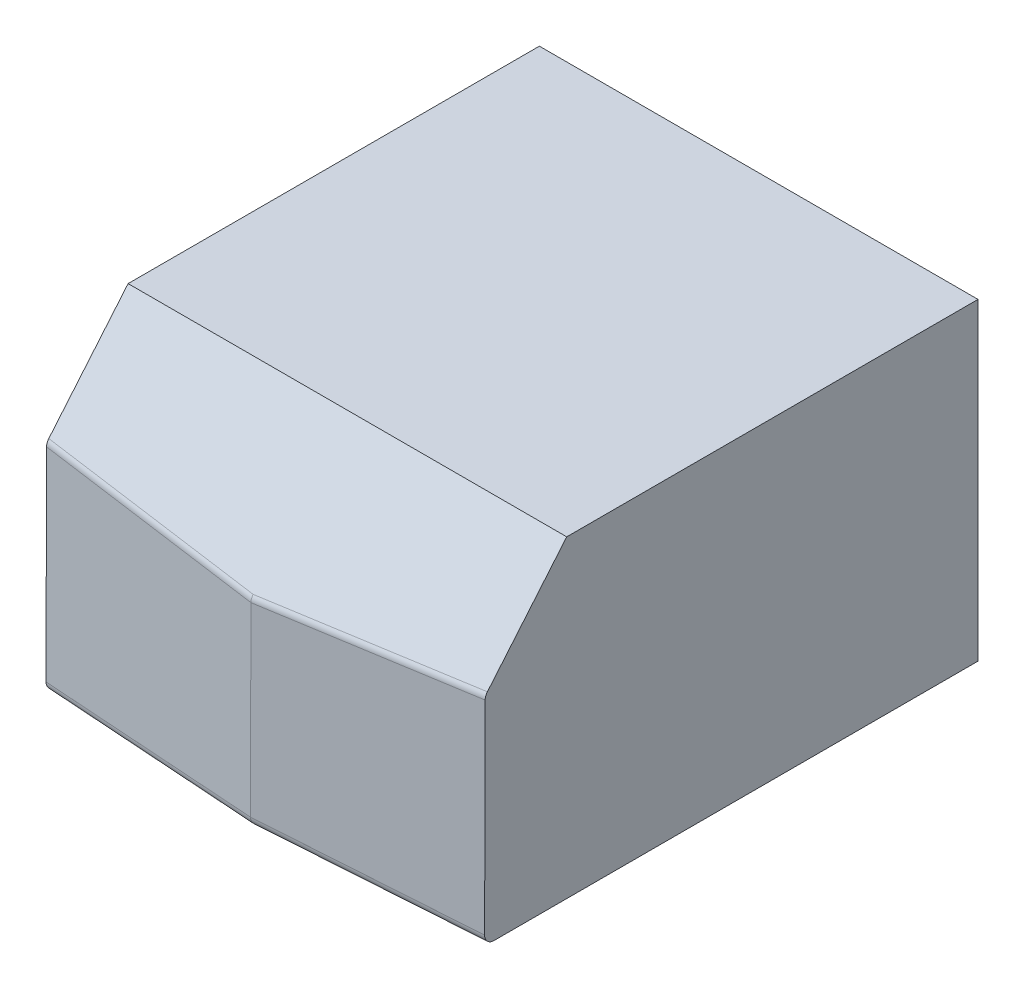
ISO-10303-21;
HEADER;
FILE_DESCRIPTION(('STEP AP214'),'2;1');
FILE_NAME('part.step','',(''),(''),'','','');
FILE_SCHEMA(('AUTOMOTIVE_DESIGN { 1 0 10303 214 1 1 1 1 }'));
ENDSEC;
DATA;
#1=APPLICATION_CONTEXT('core data for automotive mechanical design processes');
#2=APPLICATION_PROTOCOL_DEFINITION('international standard','automotive_design',2000,#1);
#3=PRODUCT_CONTEXT('',#1,'mechanical');
#4=PRODUCT('Part','Part','',(#3));
#5=PRODUCT_RELATED_PRODUCT_CATEGORY('part','',(#4));
#6=PRODUCT_DEFINITION_FORMATION('','',#4);
#7=PRODUCT_DEFINITION_CONTEXT('part definition',#1,'design');
#8=PRODUCT_DEFINITION('design','',#6,#7);
#9=PRODUCT_DEFINITION_SHAPE('','',#8);
#10=(LENGTH_UNIT() NAMED_UNIT(*) SI_UNIT(.MILLI.,.METRE.));
#11=(NAMED_UNIT(*) PLANE_ANGLE_UNIT() SI_UNIT($,.RADIAN.));
#12=(NAMED_UNIT(*) SI_UNIT($,.STERADIAN.) SOLID_ANGLE_UNIT());
#13=UNCERTAINTY_MEASURE_WITH_UNIT(LENGTH_MEASURE(1.E-05),#10,'distance_accuracy_value','');
#14=(GEOMETRIC_REPRESENTATION_CONTEXT(3) GLOBAL_UNCERTAINTY_ASSIGNED_CONTEXT((#13)) GLOBAL_UNIT_ASSIGNED_CONTEXT((#10,
#11,#12)) REPRESENTATION_CONTEXT('',''));
#15=CARTESIAN_POINT('',(0.,0.,0.));
#16=DIRECTION('',(0.,0.,1.));
#17=DIRECTION('',(1.,0.,0.));
#18=AXIS2_PLACEMENT_3D('',#15,#16,#17);
#19=CARTESIAN_POINT('',(35.,0.,90.));
#20=DIRECTION('',(-1.,0.,0.));
#21=DIRECTION('',(0.,0.,1.));
#22=AXIS2_PLACEMENT_3D('',#19,#20,#21);
#23=PLANE('',#22);
#24=CARTESIAN_POINT('',(35.,1.4999999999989,77.2357355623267));
#25=DIRECTION('',(-1.,0.,0.));
#26=DIRECTION('',(0.,0.,1.));
#27=AXIS2_PLACEMENT_3D('',#24,#25,#26);
#28=ELLIPSE('',#27,1.50345153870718,1.49999999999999);
#29=CARTESIAN_POINT('',(35.,-1.76735500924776E-12,77.2357355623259));
#30=VERTEX_POINT('',#29);
#31=CARTESIAN_POINT('',(35.,1.50000000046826,78.7391871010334));
#32=VERTEX_POINT('',#31);
#33=EDGE_CURVE('E116',#30,#32,#28,.T.);
#34=ORIENTED_EDGE('',*,*,#33,.F.);
#35=DIRECTION('',(0.,0.,-1.));
#36=VECTOR('',#35,1.);
#37=CARTESIAN_POINT('',(35.,0.,90.));
#38=LINE('',#37,#36);
#39=CARTESIAN_POINT('',(35.,0.,0.));
#40=VERTEX_POINT('',#39);
#41=EDGE_CURVE('E127',#30,#40,#38,.T.);
#42=ORIENTED_EDGE('',*,*,#41,.T.);
#43=DIRECTION('',(0.,1.,0.));
#44=VECTOR('',#43,1.);
#45=CARTESIAN_POINT('',(35.,0.,0.));
#46=LINE('',#45,#44);
#47=CARTESIAN_POINT('',(35.,50.,0.));
#48=VERTEX_POINT('',#47);
#49=EDGE_CURVE('E135',#40,#48,#46,.T.);
#50=ORIENTED_EDGE('',*,*,#49,.T.);
#51=DIRECTION('',(0.,0.,-1.));
#52=VECTOR('',#51,1.);
#53=CARTESIAN_POINT('',(35.,50.,90.));
#54=LINE('',#53,#52);
#55=CARTESIAN_POINT('',(35.,50.,65.6356282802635));
#56=VERTEX_POINT('',#55);
#57=EDGE_CURVE('E122',#56,#48,#54,.T.);
#58=ORIENTED_EDGE('',*,*,#57,.F.);
#59=DIRECTION('',(0.,-0.766044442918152,0.642787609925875));
#60=VECTOR('',#59,1.);
#61=CARTESIAN_POINT('',(35.,8.66168448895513,100.32259360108));
#62=LINE('',#61,#60);
#63=CARTESIAN_POINT('',(35.0000000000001,34.9123432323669,78.2956755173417));
#64=VERTEX_POINT('',#63);
#65=EDGE_CURVE('E138',#56,#64,#62,.T.);
#66=ORIENTED_EDGE('',*,*,#65,.T.);
#67=CARTESIAN_POINT('',(35.,33.9481618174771,77.1466088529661));
#68=DIRECTION('',(-1.,0.,0.));
#69=DIRECTION('',(0.,-0.76604444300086,0.642787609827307));
#70=AXIS2_PLACEMENT_3D('',#67,#68,#69);
#71=ELLIPSE('',#70,1.5083948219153,1.50000000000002);
#72=CARTESIAN_POINT('',(35.,33.9440281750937,78.6500773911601));
#73=VERTEX_POINT('',#72);
#74=EDGE_CURVE('E146',#73,#64,#71,.T.);
#75=ORIENTED_EDGE('',*,*,#74,.F.);
#76=DIRECTION('',(0.,-0.999996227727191,0.00274673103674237));
#77=VECTOR('',#76,1.);
#78=CARTESIAN_POINT('',(35.,-0.0309189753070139,78.7433977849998));
#79=LINE('',#78,#77);
#80=CARTESIAN_POINT('',(35.,1.50411063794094,78.7391814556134));
#81=VERTEX_POINT('',#80);
#82=EDGE_CURVE('E52',#73,#81,#79,.T.);
#83=ORIENTED_EDGE('',*,*,#82,.T.);
#84=CARTESIAN_POINT('',(35.,1.4999999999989,77.2357355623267));
#85=DIRECTION('',(-1.,0.,0.));
#86=DIRECTION('',(0.,0.,1.));
#87=AXIS2_PLACEMENT_3D('',#84,#85,#86);
#88=ELLIPSE('',#87,1.50345153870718,1.49999999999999);
#89=EDGE_CURVE('E130',#32,#81,#88,.T.);
#90=ORIENTED_EDGE('',*,*,#89,.F.);
#91=EDGE_LOOP('',(#34,#42,#50,#58,#66,#75,#83,#90));
#92=FACE_BOUND('',#91,.T.);
#93=ADVANCED_FACE('F34',(#92),#23,.F.);
#94=CARTESIAN_POINT('',(-35.,50.,90.));
#95=DIRECTION('',(0.,-1.,0.));
#96=DIRECTION('',(0.,0.,-1.));
#97=AXIS2_PLACEMENT_3D('',#94,#95,#96);
#98=PLANE('',#97);
#99=DIRECTION('',(-1.,0.,0.));
#100=VECTOR('',#99,1.);
#101=CARTESIAN_POINT('',(-35.,50.,0.));
#102=LINE('',#101,#100);
#103=CARTESIAN_POINT('',(-35.,50.,0.));
#104=VERTEX_POINT('',#103);
#105=EDGE_CURVE('E155',#48,#104,#102,.T.);
#106=ORIENTED_EDGE('',*,*,#105,.T.);
#107=DIRECTION('',(0.,0.,-1.));
#108=VECTOR('',#107,1.);
#109=CARTESIAN_POINT('',(-35.,50.,90.));
#110=LINE('',#109,#108);
#111=CARTESIAN_POINT('',(-35.,50.,65.6356282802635));
#112=VERTEX_POINT('',#111);
#113=EDGE_CURVE('E164',#112,#104,#110,.T.);
#114=ORIENTED_EDGE('',*,*,#113,.F.);
#115=DIRECTION('',(1.,0.,1.77974915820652E-11));
#116=VECTOR('',#115,1.);
#117=CARTESIAN_POINT('',(-34.9999999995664,50.,65.6356282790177));
#118=LINE('',#117,#116);
#119=EDGE_CURVE('E145',#112,#56,#118,.T.);
#120=ORIENTED_EDGE('',*,*,#119,.T.);
#121=ORIENTED_EDGE('',*,*,#57,.T.);
#122=EDGE_LOOP('',(#106,#114,#120,#121));
#123=FACE_BOUND('',#122,.T.);
#124=ADVANCED_FACE('F162',(#123),#98,.F.);
#125=CARTESIAN_POINT('',(-35.,0.,90.));
#126=DIRECTION('',(0.,1.,0.));
#127=DIRECTION('',(0.,0.,1.));
#128=AXIS2_PLACEMENT_3D('',#125,#126,#127);
#129=PLANE('',#128);
#130=DIRECTION('',(-0.997704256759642,0.,0.0677216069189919));
#131=VECTOR('',#130,1.);
#132=CARTESIAN_POINT('',(14.611701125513,-5.31352238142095E-13,78.6196410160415));
#133=LINE('',#132,#131);
#134=CARTESIAN_POINT('',(0.,-5.01157521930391E-13,79.6114458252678));
#135=VERTEX_POINT('',#134);
#136=EDGE_CURVE('E38',#30,#135,#133,.T.);
#137=ORIENTED_EDGE('',*,*,#136,.T.);
#138=DIRECTION('',(0.997704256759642,0.,0.0677216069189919));
#139=VECTOR('',#138,1.);
#140=CARTESIAN_POINT('',(-14.611701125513,-5.31352238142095E-13,78.6196410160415));
#141=LINE('',#140,#139);
#142=CARTESIAN_POINT('',(-35.,-1.76735500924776E-12,77.2357355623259));
#143=VERTEX_POINT('',#142);
#144=EDGE_CURVE('E182',#143,#135,#141,.T.);
#145=ORIENTED_EDGE('',*,*,#144,.F.);
#146=DIRECTION('',(0.,0.,-1.));
#147=VECTOR('',#146,1.);
#148=CARTESIAN_POINT('',(-35.,0.,90.));
#149=LINE('',#148,#147);
#150=CARTESIAN_POINT('',(-35.,0.,0.));
#151=VERTEX_POINT('',#150);
#152=EDGE_CURVE('E176',#143,#151,#149,.T.);
#153=ORIENTED_EDGE('',*,*,#152,.T.);
#154=DIRECTION('',(1.,0.,0.));
#155=VECTOR('',#154,1.);
#156=CARTESIAN_POINT('',(-35.,0.,0.));
#157=LINE('',#156,#155);
#158=EDGE_CURVE('E121',#151,#40,#157,.T.);
#159=ORIENTED_EDGE('',*,*,#158,.T.);
#160=ORIENTED_EDGE('',*,*,#41,.F.);
#161=EDGE_LOOP('',(#137,#145,#153,#159,#160));
#162=FACE_BOUND('',#161,.T.);
#163=ADVANCED_FACE('F36',(#162),#129,.F.);
#164=CARTESIAN_POINT('',(-35.,50.,0.));
#165=DIRECTION('',(0.,0.,-1.));
#166=DIRECTION('',(-1.,0.,0.));
#167=AXIS2_PLACEMENT_3D('',#164,#165,#166);
#168=PLANE('',#167);
#169=ORIENTED_EDGE('',*,*,#158,.F.);
#170=DIRECTION('',(0.,1.,0.));
#171=VECTOR('',#170,1.);
#172=CARTESIAN_POINT('',(-35.,0.,0.));
#173=LINE('',#172,#171);
#174=EDGE_CURVE('E171',#151,#104,#173,.T.);
#175=ORIENTED_EDGE('',*,*,#174,.T.);
#176=ORIENTED_EDGE('',*,*,#105,.F.);
#177=ORIENTED_EDGE('',*,*,#49,.F.);
#178=EDGE_LOOP('',(#169,#175,#176,#177));
#179=FACE_BOUND('',#178,.T.);
#180=ADVANCED_FACE('F172',(#179),#168,.T.);
#181=CARTESIAN_POINT('',(13.0907129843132,1.49999999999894,78.7228817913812));
#182=DIRECTION('',(-0.997704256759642,0.,0.067721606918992));
#183=DIRECTION('',(0.0677216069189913,3.13142812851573E-10,0.997704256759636));
#184=AXIS2_PLACEMENT_3D('',#181,#182,#183);
#185=CYLINDRICAL_SURFACE('',#184,1.49999999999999);
#186=CARTESIAN_POINT('',(0.,1.49999999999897,79.6114458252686));
#187=DIRECTION('',(1.,0.,0.));
#188=DIRECTION('',(0.,0.,1.));
#189=AXIS2_PLACEMENT_3D('',#186,#187,#188);
#190=ELLIPSE('',#189,1.50345153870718,1.49999999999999);
#191=CARTESIAN_POINT('',(0.,1.50000000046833,81.1148973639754));
#192=VERTEX_POINT('',#191);
#193=EDGE_CURVE('E85',#135,#192,#190,.F.);
#194=ORIENTED_EDGE('',*,*,#193,.F.);
#195=ORIENTED_EDGE('',*,*,#136,.F.);
#196=ORIENTED_EDGE('',*,*,#33,.T.);
#197=DIRECTION('',(-0.997704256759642,0.,0.067721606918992));
#198=VECTOR('',#197,1.);
#199=CARTESIAN_POINT('',(13.1922953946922,1.50000000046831,80.2194381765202));
#200=LINE('',#199,#198);
#201=EDGE_CURVE('E131',#32,#192,#200,.T.);
#202=ORIENTED_EDGE('',*,*,#201,.T.);
#203=EDGE_LOOP('',(#194,#195,#196,#202));
#204=FACE_BOUND('',#203,.T.);
#205=ADVANCED_FACE('F115',(#204),#185,.T.);
#206=CARTESIAN_POINT('',(13.0907129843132,1.49999999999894,78.7228817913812));
#207=DIRECTION('',(-0.997704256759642,0.,0.067721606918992));
#208=DIRECTION('',(0.0677216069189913,3.13142812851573E-10,0.997704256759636));
#209=AXIS2_PLACEMENT_3D('',#206,#207,#208);
#210=CYLINDRICAL_SURFACE('',#209,1.49999999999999);
#211=CARTESIAN_POINT('',(0.,1.49999999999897,79.6114458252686));
#212=DIRECTION('',(1.,0.,0.));
#213=DIRECTION('',(0.,0.,1.));
#214=AXIS2_PLACEMENT_3D('',#211,#212,#213);
#215=ELLIPSE('',#214,1.50345153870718,1.49999999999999);
#216=CARTESIAN_POINT('',(0.,1.50411063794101,81.1148917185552));
#217=VERTEX_POINT('',#216);
#218=EDGE_CURVE('E78',#192,#217,#215,.F.);
#219=ORIENTED_EDGE('',*,*,#218,.F.);
#220=ORIENTED_EDGE('',*,*,#201,.F.);
#221=ORIENTED_EDGE('',*,*,#89,.T.);
#222=DIRECTION('',(-0.997704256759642,0.,0.067721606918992));
#223=VECTOR('',#222,1.);
#224=CARTESIAN_POINT('',(14.7132831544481,1.50411063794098,80.1161917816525));
#225=LINE('',#224,#223);
#226=EDGE_CURVE('E148',#81,#217,#225,.T.);
#227=ORIENTED_EDGE('',*,*,#226,.T.);
#228=EDGE_LOOP('',(#219,#220,#221,#227));
#229=FACE_BOUND('',#228,.T.);
#230=ADVANCED_FACE('F228',(#229),#210,.T.);
#231=CARTESIAN_POINT('',(4.49999999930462,31.4728169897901,79.22366978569));
#232=DIRECTION('',(-0.994434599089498,-0.0807071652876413,0.0677213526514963));
#233=DIRECTION('',(-0.0808928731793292,0.996722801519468,-3.11396109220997E-10));
#234=AXIS2_PLACEMENT_3D('',#231,#232,#233);
#235=CYLINDRICAL_SURFACE('',#234,1.50000000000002);
#236=CARTESIAN_POINT('',(0.,31.1076021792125,79.5301213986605));
#237=DIRECTION('',(1.,0.,0.));
#238=DIRECTION('',(0.,-0.76604444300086,0.642787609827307));
#239=AXIS2_PLACEMENT_3D('',#236,#237,#238);
#240=ELLIPSE('',#239,1.5083948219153,1.50000000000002);
#241=CARTESIAN_POINT('',(0.,31.1034685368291,81.0335899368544));
#242=VERTEX_POINT('',#241);
#243=CARTESIAN_POINT('',(0.,32.0717835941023,80.6791880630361));
#244=VERTEX_POINT('',#243);
#245=EDGE_CURVE('E202',#242,#244,#240,.F.);
#246=ORIENTED_EDGE('',*,*,#245,.F.);
#247=DIRECTION('',(-0.994434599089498,-0.080707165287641,0.0677213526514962));
#248=VECTOR('',#247,1.);
#249=CARTESIAN_POINT('',(556.514743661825,76.2695633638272,43.1347364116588));
#250=LINE('',#249,#248);
#251=EDGE_CURVE('E13',#73,#242,#250,.T.);
#252=ORIENTED_EDGE('',*,*,#251,.F.);
#253=ORIENTED_EDGE('',*,*,#74,.T.);
#254=DIRECTION('',(-0.994434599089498,-0.0807071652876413,0.0677213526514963));
#255=VECTOR('',#254,1.);
#256=CARTESIAN_POINT('',(556.413161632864,77.2296341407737,42.7872523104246));
#257=LINE('',#256,#255);
#258=EDGE_CURVE('E44',#64,#244,#257,.T.);
#259=ORIENTED_EDGE('',*,*,#258,.T.);
#260=EDGE_LOOP('',(#246,#252,#253,#259));
#261=FACE_BOUND('',#260,.T.);
#262=ADVANCED_FACE('F225',(#261),#235,.T.);
#263=CARTESIAN_POINT('',(558.510215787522,75.9268007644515,43.0002303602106));
#264=DIRECTION('',(-0.0677213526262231,-0.0027404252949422,-0.99770051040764));
#265=DIRECTION('',(-0.997704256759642,0.,0.067721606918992));
#266=AXIS2_PLACEMENT_3D('',#263,#264,#265);
#267=PLANE('',#266);
#268=ORIENTED_EDGE('',*,*,#251,.T.);
#269=DIRECTION('',(0.,-0.999996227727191,0.00274673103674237));
#270=VECTOR('',#269,1.);
#271=CARTESIAN_POINT('',(0.,76.0309296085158,80.9101858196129));
#272=LINE('',#271,#270);
#273=EDGE_CURVE('E136',#242,#217,#272,.T.);
#274=ORIENTED_EDGE('',*,*,#273,.T.);
#275=ORIENTED_EDGE('',*,*,#226,.F.);
#276=ORIENTED_EDGE('',*,*,#82,.F.);
#277=EDGE_LOOP('',(#268,#274,#275,#276));
#278=FACE_BOUND('',#277,.T.);
#279=ADVANCED_FACE('F227',(#278),#267,.F.);
#280=CARTESIAN_POINT('',(-556.500000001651,76.5578661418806,43.3509325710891));
#281=DIRECTION('',(1.36336695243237E-11,-0.642787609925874,-0.766044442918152));
#282=DIRECTION('',(-1.62455234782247E-11,0.766044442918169,-0.642787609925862));
#283=AXIS2_PLACEMENT_3D('',#280,#281,#282);
#284=PLANE('',#283);
#285=ORIENTED_EDGE('',*,*,#119,.F.);
#286=DIRECTION('',(0.,-0.766044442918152,0.642787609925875));
#287=VECTOR('',#286,1.);
#288=CARTESIAN_POINT('',(-35.,8.66168448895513,100.32259360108));
#289=LINE('',#288,#287);
#290=CARTESIAN_POINT('',(-35.0000000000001,34.9123432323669,78.2956755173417));
#291=VERTEX_POINT('',#290);
#292=EDGE_CURVE('E175',#112,#291,#289,.T.);
#293=ORIENTED_EDGE('',*,*,#292,.T.);
#294=DIRECTION('',(0.994434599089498,-0.0807071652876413,0.0677213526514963));
#295=VECTOR('',#294,1.);
#296=CARTESIAN_POINT('',(-556.413161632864,77.2296341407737,42.7872523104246));
#297=LINE('',#296,#295);
#298=EDGE_CURVE('E191',#291,#244,#297,.T.);
#299=ORIENTED_EDGE('',*,*,#298,.T.);
#300=ORIENTED_EDGE('',*,*,#258,.F.);
#301=ORIENTED_EDGE('',*,*,#65,.F.);
#302=EDGE_LOOP('',(#285,#293,#299,#300,#301));
#303=FACE_BOUND('',#302,.T.);
#304=ADVANCED_FACE('F219',(#303),#284,.F.);
#305=CARTESIAN_POINT('',(-35.,0.,90.));
#306=DIRECTION('',(1.,0.,0.));
#307=DIRECTION('',(0.,0.,1.));
#308=AXIS2_PLACEMENT_3D('',#305,#306,#307);
#309=PLANE('',#308);
#310=CARTESIAN_POINT('',(-35.,1.4999999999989,77.2357355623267));
#311=DIRECTION('',(-1.,0.,0.));
#312=DIRECTION('',(0.,0.,1.));
#313=AXIS2_PLACEMENT_3D('',#310,#311,#312);
#314=ELLIPSE('',#313,1.50345153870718,1.49999999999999);
#315=CARTESIAN_POINT('',(-35.,1.50000000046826,78.7391871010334));
#316=VERTEX_POINT('',#315);
#317=EDGE_CURVE('E185',#143,#316,#314,.T.);
#318=ORIENTED_EDGE('',*,*,#317,.T.);
#319=CARTESIAN_POINT('',(-35.,1.4999999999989,77.2357355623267));
#320=DIRECTION('',(-1.,0.,0.));
#321=DIRECTION('',(0.,0.,1.));
#322=AXIS2_PLACEMENT_3D('',#319,#320,#321);
#323=ELLIPSE('',#322,1.50345153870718,1.49999999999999);
#324=CARTESIAN_POINT('',(-35.,1.50411063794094,78.7391814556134));
#325=VERTEX_POINT('',#324);
#326=EDGE_CURVE('E199',#316,#325,#323,.T.);
#327=ORIENTED_EDGE('',*,*,#326,.T.);
#328=DIRECTION('',(0.,-0.999996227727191,0.00274673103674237));
#329=VECTOR('',#328,1.);
#330=CARTESIAN_POINT('',(-35.,-0.0309189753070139,78.7433977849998));
#331=LINE('',#330,#329);
#332=CARTESIAN_POINT('',(-35.,33.9440281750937,78.6500773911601));
#333=VERTEX_POINT('',#332);
#334=EDGE_CURVE('E183',#333,#325,#331,.T.);
#335=ORIENTED_EDGE('',*,*,#334,.F.);
#336=CARTESIAN_POINT('',(-35.,33.9481618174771,77.1466088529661));
#337=DIRECTION('',(-1.,0.,0.));
#338=DIRECTION('',(0.,-0.76604444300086,0.642787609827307));
#339=AXIS2_PLACEMENT_3D('',#336,#337,#338);
#340=ELLIPSE('',#339,1.5083948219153,1.50000000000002);
#341=EDGE_CURVE('E194',#333,#291,#340,.T.);
#342=ORIENTED_EDGE('',*,*,#341,.T.);
#343=ORIENTED_EDGE('',*,*,#292,.F.);
#344=ORIENTED_EDGE('',*,*,#113,.T.);
#345=ORIENTED_EDGE('',*,*,#174,.F.);
#346=ORIENTED_EDGE('',*,*,#152,.F.);
#347=EDGE_LOOP('',(#318,#327,#335,#342,#343,#344,#345,#346));
#348=FACE_BOUND('',#347,.T.);
#349=ADVANCED_FACE('F179',(#348),#309,.F.);
#350=CARTESIAN_POINT('',(-13.0907129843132,1.49999999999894,78.7228817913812));
#351=DIRECTION('',(0.997704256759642,0.,0.067721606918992));
#352=DIRECTION('',(-0.0677216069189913,3.13142812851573E-10,0.997704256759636));
#353=AXIS2_PLACEMENT_3D('',#350,#351,#352);
#354=CYLINDRICAL_SURFACE('',#353,1.49999999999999);
#355=ORIENTED_EDGE('',*,*,#193,.T.);
#356=DIRECTION('',(0.997704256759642,0.,0.067721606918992));
#357=VECTOR('',#356,1.);
#358=CARTESIAN_POINT('',(-13.1922953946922,1.50000000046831,80.2194381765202));
#359=LINE('',#358,#357);
#360=EDGE_CURVE('E200',#316,#192,#359,.T.);
#361=ORIENTED_EDGE('',*,*,#360,.F.);
#362=ORIENTED_EDGE('',*,*,#317,.F.);
#363=ORIENTED_EDGE('',*,*,#144,.T.);
#364=EDGE_LOOP('',(#355,#361,#362,#363));
#365=FACE_BOUND('',#364,.T.);
#366=ADVANCED_FACE('F207',(#365),#354,.T.);
#367=CARTESIAN_POINT('',(-13.0907129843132,1.49999999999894,78.7228817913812));
#368=DIRECTION('',(0.997704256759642,0.,0.067721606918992));
#369=DIRECTION('',(-0.0677216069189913,3.13142812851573E-10,0.997704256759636));
#370=AXIS2_PLACEMENT_3D('',#367,#368,#369);
#371=CYLINDRICAL_SURFACE('',#370,1.49999999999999);
#372=ORIENTED_EDGE('',*,*,#218,.T.);
#373=DIRECTION('',(0.997704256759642,0.,0.067721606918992));
#374=VECTOR('',#373,1.);
#375=CARTESIAN_POINT('',(-14.7132831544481,1.50411063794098,80.1161917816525));
#376=LINE('',#375,#374);
#377=EDGE_CURVE('E196',#325,#217,#376,.T.);
#378=ORIENTED_EDGE('',*,*,#377,.F.);
#379=ORIENTED_EDGE('',*,*,#326,.F.);
#380=ORIENTED_EDGE('',*,*,#360,.T.);
#381=EDGE_LOOP('',(#372,#378,#379,#380));
#382=FACE_BOUND('',#381,.T.);
#383=ADVANCED_FACE('F232',(#382),#371,.T.);
#384=CARTESIAN_POINT('',(-4.49999999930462,31.4728169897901,79.22366978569));
#385=DIRECTION('',(0.994434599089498,-0.0807071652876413,0.0677213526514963));
#386=DIRECTION('',(0.0808928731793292,0.996722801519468,-3.11396109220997E-10));
#387=AXIS2_PLACEMENT_3D('',#384,#385,#386);
#388=CYLINDRICAL_SURFACE('',#387,1.50000000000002);
#389=ORIENTED_EDGE('',*,*,#245,.T.);
#390=ORIENTED_EDGE('',*,*,#298,.F.);
#391=ORIENTED_EDGE('',*,*,#341,.F.);
#392=DIRECTION('',(0.994434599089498,-0.080707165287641,0.0677213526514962));
#393=VECTOR('',#392,1.);
#394=CARTESIAN_POINT('',(-556.514743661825,76.2695633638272,43.1347364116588));
#395=LINE('',#394,#393);
#396=EDGE_CURVE('E94',#333,#242,#395,.T.);
#397=ORIENTED_EDGE('',*,*,#396,.T.);
#398=EDGE_LOOP('',(#389,#390,#391,#397));
#399=FACE_BOUND('',#398,.T.);
#400=ADVANCED_FACE('F223',(#399),#388,.T.);
#401=CARTESIAN_POINT('',(-558.510215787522,75.9268007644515,43.0002303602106));
#402=DIRECTION('',(0.0677213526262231,-0.0027404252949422,-0.99770051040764));
#403=DIRECTION('',(0.997704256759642,0.,0.067721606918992));
#404=AXIS2_PLACEMENT_3D('',#401,#402,#403);
#405=PLANE('',#404);
#406=ORIENTED_EDGE('',*,*,#396,.F.);
#407=ORIENTED_EDGE('',*,*,#334,.T.);
#408=ORIENTED_EDGE('',*,*,#377,.T.);
#409=ORIENTED_EDGE('',*,*,#273,.F.);
#410=EDGE_LOOP('',(#406,#407,#408,#409));
#411=FACE_BOUND('',#410,.T.);
#412=ADVANCED_FACE('F230',(#411),#405,.F.);
#413=CLOSED_SHELL('',(#93,#124,#163,#180,#205,#230,#262,#279,#304,#349,#366,#383,#400,#412));
#414=MANIFOLD_SOLID_BREP('B2',#413);
#415=ADVANCED_BREP_SHAPE_REPRESENTATION('',(#18,#414),#14);
#416=SHAPE_DEFINITION_REPRESENTATION(#9,#415);
ENDSEC;
END-ISO-10303-21;
